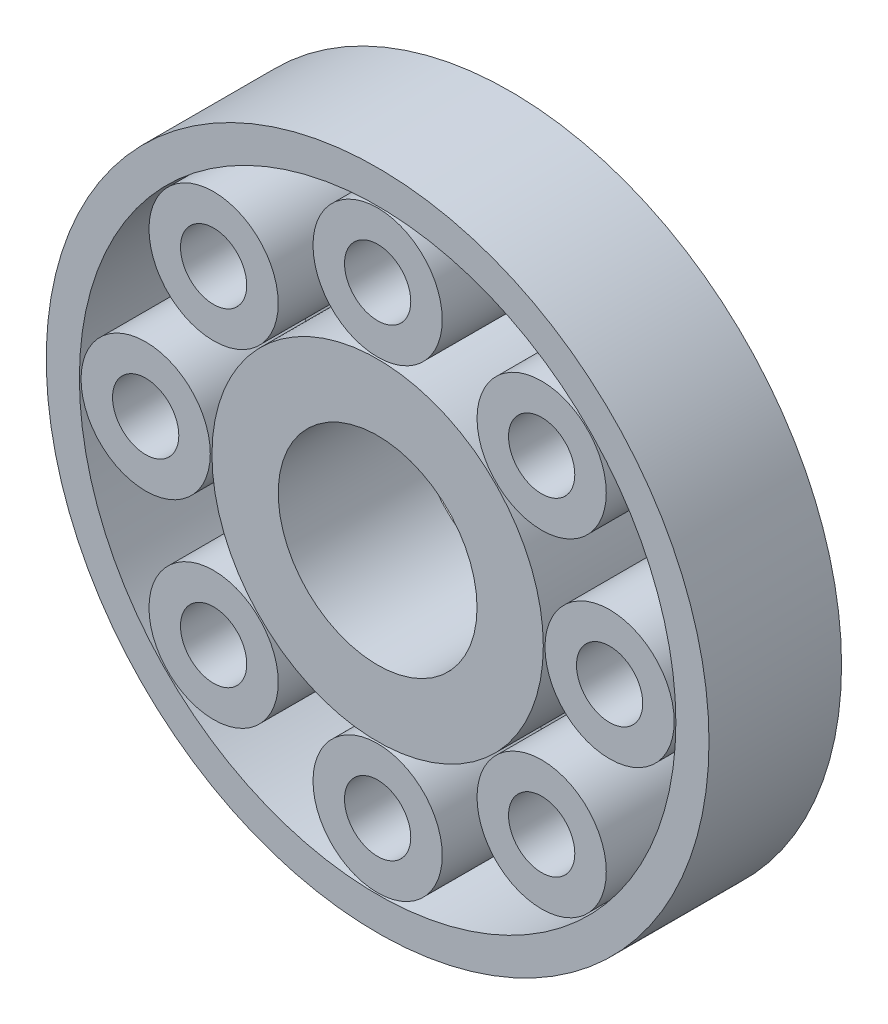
ISO-10303-21;
HEADER;
FILE_DESCRIPTION(('STEP AP214'),'2;1');
FILE_NAME('part.step','',(''),(''),'','','');
FILE_SCHEMA(('AUTOMOTIVE_DESIGN { 1 0 10303 214 1 1 1 1 }'));
ENDSEC;
DATA;
#1=APPLICATION_CONTEXT('core data for automotive mechanical design processes');
#2=APPLICATION_PROTOCOL_DEFINITION('international standard','automotive_design',2000,#1);
#3=PRODUCT_CONTEXT('',#1,'mechanical');
#4=PRODUCT('Part','Part','',(#3));
#5=PRODUCT_RELATED_PRODUCT_CATEGORY('part','',(#4));
#6=PRODUCT_DEFINITION_FORMATION('','',#4);
#7=PRODUCT_DEFINITION_CONTEXT('part definition',#1,'design');
#8=PRODUCT_DEFINITION('design','',#6,#7);
#9=PRODUCT_DEFINITION_SHAPE('','',#8);
#10=(LENGTH_UNIT() NAMED_UNIT(*) SI_UNIT(.MILLI.,.METRE.));
#11=(NAMED_UNIT(*) PLANE_ANGLE_UNIT() SI_UNIT($,.RADIAN.));
#12=(NAMED_UNIT(*) SI_UNIT($,.STERADIAN.) SOLID_ANGLE_UNIT());
#13=UNCERTAINTY_MEASURE_WITH_UNIT(LENGTH_MEASURE(1.E-05),#10,'distance_accuracy_value','');
#14=(GEOMETRIC_REPRESENTATION_CONTEXT(3) GLOBAL_UNCERTAINTY_ASSIGNED_CONTEXT((#13)) GLOBAL_UNIT_ASSIGNED_CONTEXT((#10,
#11,#12)) REPRESENTATION_CONTEXT('',''));
#15=CARTESIAN_POINT('',(0.,0.,0.));
#16=DIRECTION('',(0.,0.,1.));
#17=DIRECTION('',(1.,0.,0.));
#18=AXIS2_PLACEMENT_3D('',#15,#16,#17);
#19=CARTESIAN_POINT('',(0.,0.,0.));
#20=DIRECTION('',(0.,0.,1.));
#21=DIRECTION('',(1.,0.,0.));
#22=AXIS2_PLACEMENT_3D('',#19,#20,#21);
#23=PLANE('',#22);
#24=CARTESIAN_POINT('',(-4.94974746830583,4.94974746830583,0.));
#25=DIRECTION('',(0.,0.,1.));
#26=DIRECTION('',(1.,0.,0.));
#27=AXIS2_PLACEMENT_3D('',#24,#25,#26);
#28=CIRCLE('',#27,1.00000000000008);
#29=CARTESIAN_POINT('',(-3.94974746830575,4.94974746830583,0.));
#30=VERTEX_POINT('',#29);
#31=EDGE_CURVE('E164',#30,#30,#28,.F.);
#32=ORIENTED_EDGE('',*,*,#31,.F.);
#33=EDGE_LOOP('',(#32));
#34=FACE_BOUND('',#33,.T.);
#35=CARTESIAN_POINT('',(-7.,0.,0.));
#36=DIRECTION('',(0.,0.,1.));
#37=DIRECTION('',(1.,0.,0.));
#38=AXIS2_PLACEMENT_3D('',#35,#36,#37);
#39=CIRCLE('',#38,1.00000000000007);
#40=CARTESIAN_POINT('',(-5.99999999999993,0.,0.));
#41=VERTEX_POINT('',#40);
#42=EDGE_CURVE('E158',#41,#41,#39,.F.);
#43=ORIENTED_EDGE('',*,*,#42,.F.);
#44=EDGE_LOOP('',(#43));
#45=FACE_BOUND('',#44,.T.);
#46=CARTESIAN_POINT('',(-4.94974746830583,-4.94974746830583,0.));
#47=DIRECTION('',(0.,0.,1.));
#48=DIRECTION('',(1.,0.,0.));
#49=AXIS2_PLACEMENT_3D('',#46,#47,#48);
#50=CIRCLE('',#49,1.00000000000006);
#51=CARTESIAN_POINT('',(-3.94974746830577,-4.94974746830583,0.));
#52=VERTEX_POINT('',#51);
#53=EDGE_CURVE('E152',#52,#52,#50,.F.);
#54=ORIENTED_EDGE('',*,*,#53,.F.);
#55=EDGE_LOOP('',(#54));
#56=FACE_BOUND('',#55,.T.);
#57=CARTESIAN_POINT('',(0.,-7.,0.));
#58=DIRECTION('',(0.,0.,1.));
#59=DIRECTION('',(1.,0.,0.));
#60=AXIS2_PLACEMENT_3D('',#57,#58,#59);
#61=CIRCLE('',#60,1.00000000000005);
#62=CARTESIAN_POINT('',(1.00000000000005,-7.,0.));
#63=VERTEX_POINT('',#62);
#64=EDGE_CURVE('E146',#63,#63,#61,.F.);
#65=ORIENTED_EDGE('',*,*,#64,.F.);
#66=EDGE_LOOP('',(#65));
#67=FACE_BOUND('',#66,.T.);
#68=CARTESIAN_POINT('',(4.94974746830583,-4.94974746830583,0.));
#69=DIRECTION('',(0.,0.,1.));
#70=DIRECTION('',(1.,0.,0.));
#71=AXIS2_PLACEMENT_3D('',#68,#69,#70);
#72=CIRCLE('',#71,1.00000000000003);
#73=CARTESIAN_POINT('',(5.94974746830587,-4.94974746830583,0.));
#74=VERTEX_POINT('',#73);
#75=EDGE_CURVE('E140',#74,#74,#72,.F.);
#76=ORIENTED_EDGE('',*,*,#75,.F.);
#77=EDGE_LOOP('',(#76));
#78=FACE_BOUND('',#77,.T.);
#79=CARTESIAN_POINT('',(7.,0.,0.));
#80=DIRECTION('',(0.,0.,1.));
#81=DIRECTION('',(1.,0.,0.));
#82=AXIS2_PLACEMENT_3D('',#79,#80,#81);
#83=CIRCLE('',#82,1.00000000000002);
#84=CARTESIAN_POINT('',(8.00000000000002,0.,0.));
#85=VERTEX_POINT('',#84);
#86=EDGE_CURVE('E134',#85,#85,#83,.F.);
#87=ORIENTED_EDGE('',*,*,#86,.F.);
#88=EDGE_LOOP('',(#87));
#89=FACE_BOUND('',#88,.T.);
#90=CARTESIAN_POINT('',(4.94974746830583,4.94974746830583,0.));
#91=DIRECTION('',(0.,0.,1.));
#92=DIRECTION('',(1.,0.,0.));
#93=AXIS2_PLACEMENT_3D('',#90,#91,#92);
#94=CIRCLE('',#93,1.00000000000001);
#95=CARTESIAN_POINT('',(5.94974746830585,4.94974746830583,0.));
#96=VERTEX_POINT('',#95);
#97=EDGE_CURVE('E128',#96,#96,#94,.F.);
#98=ORIENTED_EDGE('',*,*,#97,.F.);
#99=EDGE_LOOP('',(#98));
#100=FACE_BOUND('',#99,.T.);
#101=CARTESIAN_POINT('',(0.,7.,0.));
#102=DIRECTION('',(0.,0.,1.));
#103=DIRECTION('',(1.,0.,0.));
#104=AXIS2_PLACEMENT_3D('',#101,#102,#103);
#105=CIRCLE('',#104,1.);
#106=CARTESIAN_POINT('',(1.,7.,0.));
#107=VERTEX_POINT('',#106);
#108=EDGE_CURVE('E120',#107,#107,#105,.F.);
#109=ORIENTED_EDGE('',*,*,#108,.F.);
#110=EDGE_LOOP('',(#109));
#111=FACE_BOUND('',#110,.T.);
#112=CARTESIAN_POINT('',(0.,0.,0.));
#113=DIRECTION('',(0.,0.,1.));
#114=DIRECTION('',(1.,0.,0.));
#115=AXIS2_PLACEMENT_3D('',#112,#113,#114);
#116=CIRCLE('',#115,10.);
#117=CARTESIAN_POINT('',(10.,0.,0.));
#118=VERTEX_POINT('',#117);
#119=EDGE_CURVE('E51',#118,#118,#116,.T.);
#120=ORIENTED_EDGE('',*,*,#119,.F.);
#121=EDGE_LOOP('',(#120));
#122=FACE_BOUND('',#121,.T.);
#123=CARTESIAN_POINT('',(0.,0.,0.));
#124=DIRECTION('',(0.,0.,1.));
#125=DIRECTION('',(1.,0.,0.));
#126=AXIS2_PLACEMENT_3D('',#123,#124,#125);
#127=CIRCLE('',#126,4.);
#128=CARTESIAN_POINT('',(4.,0.,0.));
#129=VERTEX_POINT('',#128);
#130=EDGE_CURVE('E44',#129,#129,#127,.F.);
#131=ORIENTED_EDGE('',*,*,#130,.F.);
#132=EDGE_LOOP('',(#131));
#133=FACE_BOUND('',#132,.T.);
#134=ADVANCED_FACE('F33',(#34,#45,#56,#67,#78,#89,#100,#111,#122,#133),#23,.F.);
#135=CARTESIAN_POINT('',(0.,0.,4.));
#136=DIRECTION('',(0.,0.,-1.));
#137=DIRECTION('',(-1.,0.,0.));
#138=AXIS2_PLACEMENT_3D('',#135,#136,#137);
#139=CYLINDRICAL_SURFACE('',#138,10.);
#140=CARTESIAN_POINT('',(0.,0.,4.));
#141=DIRECTION('',(0.,0.,1.));
#142=DIRECTION('',(1.,0.,0.));
#143=AXIS2_PLACEMENT_3D('',#140,#141,#142);
#144=CIRCLE('',#143,10.);
#145=CARTESIAN_POINT('',(10.,0.,4.));
#146=VERTEX_POINT('',#145);
#147=EDGE_CURVE('E48',#146,#146,#144,.T.);
#148=ORIENTED_EDGE('',*,*,#147,.F.);
#149=EDGE_LOOP('',(#148));
#150=FACE_BOUND('',#149,.T.);
#151=ORIENTED_EDGE('',*,*,#119,.T.);
#152=EDGE_LOOP('',(#151));
#153=FACE_BOUND('',#152,.T.);
#154=ADVANCED_FACE('F200',(#150,#153),#139,.T.);
#155=CARTESIAN_POINT('',(0.,0.,4.));
#156=DIRECTION('',(0.,0.,1.));
#157=DIRECTION('',(1.,0.,0.));
#158=AXIS2_PLACEMENT_3D('',#155,#156,#157);
#159=PLANE('',#158);
#160=CARTESIAN_POINT('',(0.,0.,4.));
#161=DIRECTION('',(0.,0.,1.));
#162=DIRECTION('',(1.,0.,0.));
#163=AXIS2_PLACEMENT_3D('',#160,#161,#162);
#164=CIRCLE('',#163,9.);
#165=CARTESIAN_POINT('',(9.,0.,4.));
#166=VERTEX_POINT('',#165);
#167=EDGE_CURVE('E57',#166,#166,#164,.F.);
#168=ORIENTED_EDGE('',*,*,#167,.T.);
#169=EDGE_LOOP('',(#168));
#170=FACE_BOUND('',#169,.T.);
#171=ORIENTED_EDGE('',*,*,#147,.T.);
#172=EDGE_LOOP('',(#171));
#173=FACE_BOUND('',#172,.T.);
#174=ADVANCED_FACE('F206',(#170,#173),#159,.T.);
#175=CARTESIAN_POINT('',(0.,7.,29.4558441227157));
#176=DIRECTION('',(0.,0.,-1.));
#177=DIRECTION('',(-1.,0.,0.));
#178=AXIS2_PLACEMENT_3D('',#175,#176,#177);
#179=CYLINDRICAL_SURFACE('',#178,1.95);
#180=CARTESIAN_POINT('',(0.,7.,0.5));
#181=DIRECTION('',(0.,0.,-1.));
#182=DIRECTION('',(-1.,0.,0.));
#183=AXIS2_PLACEMENT_3D('',#180,#181,#182);
#184=CIRCLE('',#183,1.95);
#185=CARTESIAN_POINT('',(-1.95,7.,0.5));
#186=VERTEX_POINT('',#185);
#187=EDGE_CURVE('E66',#186,#186,#184,.T.);
#188=ORIENTED_EDGE('',*,*,#187,.F.);
#189=EDGE_LOOP('',(#188));
#190=FACE_BOUND('',#189,.T.);
#191=CARTESIAN_POINT('',(0.,7.,4.));
#192=DIRECTION('',(0.,0.,1.));
#193=DIRECTION('',(1.,0.,0.));
#194=AXIS2_PLACEMENT_3D('',#191,#192,#193);
#195=CIRCLE('',#194,1.95);
#196=CARTESIAN_POINT('',(1.95,7.,4.));
#197=VERTEX_POINT('',#196);
#198=EDGE_CURVE('E54',#197,#197,#195,.F.);
#199=ORIENTED_EDGE('',*,*,#198,.T.);
#200=EDGE_LOOP('',(#199));
#201=FACE_BOUND('',#200,.T.);
#202=ADVANCED_FACE('F195',(#190,#201),#179,.T.);
#203=CARTESIAN_POINT('',(0.,0.,29.4558441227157));
#204=DIRECTION('',(0.,0.,-1.));
#205=DIRECTION('',(-1.,0.,0.));
#206=AXIS2_PLACEMENT_3D('',#203,#204,#205);
#207=CYLINDRICAL_SURFACE('',#206,5.);
#208=CARTESIAN_POINT('',(0.,0.,0.5));
#209=DIRECTION('',(0.,0.,-1.));
#210=DIRECTION('',(-1.,0.,0.));
#211=AXIS2_PLACEMENT_3D('',#208,#209,#210);
#212=CIRCLE('',#211,5.);
#213=CARTESIAN_POINT('',(-5.,0.,0.5));
#214=VERTEX_POINT('',#213);
#215=EDGE_CURVE('E69',#214,#214,#212,.T.);
#216=ORIENTED_EDGE('',*,*,#215,.F.);
#217=EDGE_LOOP('',(#216));
#218=FACE_BOUND('',#217,.T.);
#219=CARTESIAN_POINT('',(0.,0.,4.));
#220=DIRECTION('',(0.,0.,1.));
#221=DIRECTION('',(1.,0.,0.));
#222=AXIS2_PLACEMENT_3D('',#219,#220,#221);
#223=CIRCLE('',#222,5.);
#224=CARTESIAN_POINT('',(5.,0.,4.));
#225=VERTEX_POINT('',#224);
#226=EDGE_CURVE('E94',#225,#225,#223,.F.);
#227=ORIENTED_EDGE('',*,*,#226,.T.);
#228=EDGE_LOOP('',(#227));
#229=FACE_BOUND('',#228,.T.);
#230=ADVANCED_FACE('F185',(#218,#229),#207,.T.);
#231=CARTESIAN_POINT('',(-4.94974746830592,4.94974746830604,29.4558441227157));
#232=DIRECTION('',(0.,0.,-1.));
#233=DIRECTION('',(-1.,0.,0.));
#234=AXIS2_PLACEMENT_3D('',#231,#232,#233);
#235=CYLINDRICAL_SURFACE('',#234,1.95);
#236=CARTESIAN_POINT('',(-4.94974746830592,4.94974746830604,0.5));
#237=DIRECTION('',(0.,0.,-1.));
#238=DIRECTION('',(-1.,0.,0.));
#239=AXIS2_PLACEMENT_3D('',#236,#237,#238);
#240=CIRCLE('',#239,1.95);
#241=CARTESIAN_POINT('',(-6.89974746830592,4.94974746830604,0.5));
#242=VERTEX_POINT('',#241);
#243=EDGE_CURVE('E72',#242,#242,#240,.T.);
#244=ORIENTED_EDGE('',*,*,#243,.F.);
#245=EDGE_LOOP('',(#244));
#246=FACE_BOUND('',#245,.T.);
#247=CARTESIAN_POINT('',(-4.94974746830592,4.94974746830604,4.));
#248=DIRECTION('',(0.,0.,1.));
#249=DIRECTION('',(1.,0.,0.));
#250=AXIS2_PLACEMENT_3D('',#247,#248,#249);
#251=CIRCLE('',#250,1.95);
#252=CARTESIAN_POINT('',(-2.99974746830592,4.94974746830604,4.));
#253=VERTEX_POINT('',#252);
#254=EDGE_CURVE('E97',#253,#253,#251,.F.);
#255=ORIENTED_EDGE('',*,*,#254,.T.);
#256=EDGE_LOOP('',(#255));
#257=FACE_BOUND('',#256,.T.);
#258=ADVANCED_FACE('F182',(#246,#257),#235,.T.);
#259=CARTESIAN_POINT('',(-7.0000000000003,2.97570696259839E-13,29.4558441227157));
#260=DIRECTION('',(0.,0.,-1.));
#261=DIRECTION('',(-1.,0.,0.));
#262=AXIS2_PLACEMENT_3D('',#259,#260,#261);
#263=CYLINDRICAL_SURFACE('',#262,1.95);
#264=CARTESIAN_POINT('',(-7.0000000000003,2.97570696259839E-13,0.5));
#265=DIRECTION('',(0.,0.,-1.));
#266=DIRECTION('',(-1.,0.,0.));
#267=AXIS2_PLACEMENT_3D('',#264,#265,#266);
#268=CIRCLE('',#267,1.95);
#269=CARTESIAN_POINT('',(-8.9500000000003,2.97570696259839E-13,0.5));
#270=VERTEX_POINT('',#269);
#271=EDGE_CURVE('E75',#270,#270,#268,.T.);
#272=ORIENTED_EDGE('',*,*,#271,.F.);
#273=EDGE_LOOP('',(#272));
#274=FACE_BOUND('',#273,.T.);
#275=CARTESIAN_POINT('',(-7.0000000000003,2.97570696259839E-13,4.));
#276=DIRECTION('',(0.,0.,1.));
#277=DIRECTION('',(1.,0.,0.));
#278=AXIS2_PLACEMENT_3D('',#275,#276,#277);
#279=CIRCLE('',#278,1.95);
#280=CARTESIAN_POINT('',(-5.0500000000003,2.97570696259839E-13,4.));
#281=VERTEX_POINT('',#280);
#282=EDGE_CURVE('E100',#281,#281,#279,.F.);
#283=ORIENTED_EDGE('',*,*,#282,.T.);
#284=EDGE_LOOP('',(#283));
#285=FACE_BOUND('',#284,.T.);
#286=ADVANCED_FACE('F184',(#274,#285),#263,.T.);
#287=CARTESIAN_POINT('',(-4.94974746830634,-4.94974746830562,29.4558441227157));
#288=DIRECTION('',(0.,0.,-1.));
#289=DIRECTION('',(-1.,0.,0.));
#290=AXIS2_PLACEMENT_3D('',#287,#288,#289);
#291=CYLINDRICAL_SURFACE('',#290,1.95);
#292=CARTESIAN_POINT('',(-4.94974746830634,-4.94974746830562,0.5));
#293=DIRECTION('',(0.,0.,-1.));
#294=DIRECTION('',(-1.,0.,0.));
#295=AXIS2_PLACEMENT_3D('',#292,#293,#294);
#296=CIRCLE('',#295,1.95);
#297=CARTESIAN_POINT('',(-6.89974746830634,-4.94974746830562,0.5));
#298=VERTEX_POINT('',#297);
#299=EDGE_CURVE('E78',#298,#298,#296,.T.);
#300=ORIENTED_EDGE('',*,*,#299,.F.);
#301=EDGE_LOOP('',(#300));
#302=FACE_BOUND('',#301,.T.);
#303=CARTESIAN_POINT('',(-4.94974746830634,-4.94974746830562,4.));
#304=DIRECTION('',(0.,0.,1.));
#305=DIRECTION('',(1.,0.,0.));
#306=AXIS2_PLACEMENT_3D('',#303,#304,#305);
#307=CIRCLE('',#306,1.95);
#308=CARTESIAN_POINT('',(-2.99974746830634,-4.94974746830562,4.));
#309=VERTEX_POINT('',#308);
#310=EDGE_CURVE('E103',#309,#309,#307,.F.);
#311=ORIENTED_EDGE('',*,*,#310,.T.);
#312=EDGE_LOOP('',(#311));
#313=FACE_BOUND('',#312,.T.);
#314=ADVANCED_FACE('F192',(#302,#313),#291,.T.);
#315=CARTESIAN_POINT('',(-5.95141392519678E-13,-7.,29.4558441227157));
#316=DIRECTION('',(0.,0.,-1.));
#317=DIRECTION('',(-1.,0.,0.));
#318=AXIS2_PLACEMENT_3D('',#315,#316,#317);
#319=CYLINDRICAL_SURFACE('',#318,1.95);
#320=CARTESIAN_POINT('',(-5.95141392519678E-13,-7.,0.5));
#321=DIRECTION('',(0.,0.,-1.));
#322=DIRECTION('',(-1.,0.,0.));
#323=AXIS2_PLACEMENT_3D('',#320,#321,#322);
#324=CIRCLE('',#323,1.95);
#325=CARTESIAN_POINT('',(-1.9500000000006,-7.,0.5));
#326=VERTEX_POINT('',#325);
#327=EDGE_CURVE('E81',#326,#326,#324,.T.);
#328=ORIENTED_EDGE('',*,*,#327,.F.);
#329=EDGE_LOOP('',(#328));
#330=FACE_BOUND('',#329,.T.);
#331=CARTESIAN_POINT('',(-5.95141392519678E-13,-7.,4.));
#332=DIRECTION('',(0.,0.,1.));
#333=DIRECTION('',(1.,0.,0.));
#334=AXIS2_PLACEMENT_3D('',#331,#332,#333);
#335=CIRCLE('',#334,1.95);
#336=CARTESIAN_POINT('',(1.9499999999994,-7.,4.));
#337=VERTEX_POINT('',#336);
#338=EDGE_CURVE('E106',#337,#337,#335,.F.);
#339=ORIENTED_EDGE('',*,*,#338,.T.);
#340=EDGE_LOOP('',(#339));
#341=FACE_BOUND('',#340,.T.);
#342=ADVANCED_FACE('F227',(#330,#341),#319,.T.);
#343=CARTESIAN_POINT('',(4.94974746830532,-4.94974746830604,29.4558441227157));
#344=DIRECTION('',(0.,0.,-1.));
#345=DIRECTION('',(-1.,0.,0.));
#346=AXIS2_PLACEMENT_3D('',#343,#344,#345);
#347=CYLINDRICAL_SURFACE('',#346,1.95);
#348=CARTESIAN_POINT('',(4.94974746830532,-4.94974746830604,0.5));
#349=DIRECTION('',(0.,0.,-1.));
#350=DIRECTION('',(-1.,0.,0.));
#351=AXIS2_PLACEMENT_3D('',#348,#349,#350);
#352=CIRCLE('',#351,1.95);
#353=CARTESIAN_POINT('',(2.99974746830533,-4.94974746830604,0.5));
#354=VERTEX_POINT('',#353);
#355=EDGE_CURVE('E84',#354,#354,#352,.T.);
#356=ORIENTED_EDGE('',*,*,#355,.F.);
#357=EDGE_LOOP('',(#356));
#358=FACE_BOUND('',#357,.T.);
#359=CARTESIAN_POINT('',(4.94974746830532,-4.94974746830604,4.));
#360=DIRECTION('',(0.,0.,1.));
#361=DIRECTION('',(1.,0.,0.));
#362=AXIS2_PLACEMENT_3D('',#359,#360,#361);
#363=CIRCLE('',#362,1.95);
#364=CARTESIAN_POINT('',(6.89974746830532,-4.94974746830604,4.));
#365=VERTEX_POINT('',#364);
#366=EDGE_CURVE('E109',#365,#365,#363,.F.);
#367=ORIENTED_EDGE('',*,*,#366,.T.);
#368=EDGE_LOOP('',(#367));
#369=FACE_BOUND('',#368,.T.);
#370=ADVANCED_FACE('F223',(#358,#369),#347,.T.);
#371=CARTESIAN_POINT('',(6.9999999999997,-2.98427949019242E-13,29.4558441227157));
#372=DIRECTION('',(0.,0.,-1.));
#373=DIRECTION('',(-1.,0.,0.));
#374=AXIS2_PLACEMENT_3D('',#371,#372,#373);
#375=CYLINDRICAL_SURFACE('',#374,1.95);
#376=CARTESIAN_POINT('',(6.9999999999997,-2.98427949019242E-13,0.5));
#377=DIRECTION('',(0.,0.,-1.));
#378=DIRECTION('',(-1.,0.,0.));
#379=AXIS2_PLACEMENT_3D('',#376,#377,#378);
#380=CIRCLE('',#379,1.95);
#381=CARTESIAN_POINT('',(5.0499999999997,-2.98427949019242E-13,0.5));
#382=VERTEX_POINT('',#381);
#383=EDGE_CURVE('E87',#382,#382,#380,.T.);
#384=ORIENTED_EDGE('',*,*,#383,.F.);
#385=EDGE_LOOP('',(#384));
#386=FACE_BOUND('',#385,.T.);
#387=CARTESIAN_POINT('',(6.9999999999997,-2.98427949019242E-13,4.));
#388=DIRECTION('',(0.,0.,1.));
#389=DIRECTION('',(1.,0.,0.));
#390=AXIS2_PLACEMENT_3D('',#387,#388,#389);
#391=CIRCLE('',#390,1.95);
#392=CARTESIAN_POINT('',(8.9499999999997,-2.98427949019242E-13,4.));
#393=VERTEX_POINT('',#392);
#394=EDGE_CURVE('E112',#393,#393,#391,.F.);
#395=ORIENTED_EDGE('',*,*,#394,.T.);
#396=EDGE_LOOP('',(#395));
#397=FACE_BOUND('',#396,.T.);
#398=ADVANCED_FACE('F219',(#386,#397),#375,.T.);
#399=CARTESIAN_POINT('',(4.94974746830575,4.94974746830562,29.4558441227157));
#400=DIRECTION('',(0.,0.,-1.));
#401=DIRECTION('',(-1.,0.,0.));
#402=AXIS2_PLACEMENT_3D('',#399,#400,#401);
#403=CYLINDRICAL_SURFACE('',#402,1.95);
#404=CARTESIAN_POINT('',(4.94974746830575,4.94974746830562,0.5));
#405=DIRECTION('',(0.,0.,-1.));
#406=DIRECTION('',(-1.,0.,0.));
#407=AXIS2_PLACEMENT_3D('',#404,#405,#406);
#408=CIRCLE('',#407,1.95);
#409=CARTESIAN_POINT('',(2.99974746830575,4.94974746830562,0.5));
#410=VERTEX_POINT('',#409);
#411=EDGE_CURVE('E60',#410,#410,#408,.T.);
#412=ORIENTED_EDGE('',*,*,#411,.F.);
#413=EDGE_LOOP('',(#412));
#414=FACE_BOUND('',#413,.T.);
#415=CARTESIAN_POINT('',(4.94974746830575,4.94974746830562,4.));
#416=DIRECTION('',(0.,0.,1.));
#417=DIRECTION('',(1.,0.,0.));
#418=AXIS2_PLACEMENT_3D('',#415,#416,#417);
#419=CIRCLE('',#418,1.95);
#420=CARTESIAN_POINT('',(6.89974746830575,4.94974746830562,4.));
#421=VERTEX_POINT('',#420);
#422=EDGE_CURVE('E65',#421,#421,#419,.F.);
#423=ORIENTED_EDGE('',*,*,#422,.T.);
#424=EDGE_LOOP('',(#423));
#425=FACE_BOUND('',#424,.T.);
#426=ADVANCED_FACE('F215',(#414,#425),#403,.T.);
#427=CARTESIAN_POINT('',(0.,0.,0.5));
#428=DIRECTION('',(0.,0.,-1.));
#429=DIRECTION('',(-1.,0.,0.));
#430=AXIS2_PLACEMENT_3D('',#427,#428,#429);
#431=PLANE('',#430);
#432=ORIENTED_EDGE('',*,*,#411,.T.);
#433=EDGE_LOOP('',(#432));
#434=FACE_BOUND('',#433,.T.);
#435=ORIENTED_EDGE('',*,*,#383,.T.);
#436=EDGE_LOOP('',(#435));
#437=FACE_BOUND('',#436,.T.);
#438=ORIENTED_EDGE('',*,*,#355,.T.);
#439=EDGE_LOOP('',(#438));
#440=FACE_BOUND('',#439,.T.);
#441=ORIENTED_EDGE('',*,*,#327,.T.);
#442=EDGE_LOOP('',(#441));
#443=FACE_BOUND('',#442,.T.);
#444=ORIENTED_EDGE('',*,*,#299,.T.);
#445=EDGE_LOOP('',(#444));
#446=FACE_BOUND('',#445,.T.);
#447=ORIENTED_EDGE('',*,*,#271,.T.);
#448=EDGE_LOOP('',(#447));
#449=FACE_BOUND('',#448,.T.);
#450=ORIENTED_EDGE('',*,*,#243,.T.);
#451=EDGE_LOOP('',(#450));
#452=FACE_BOUND('',#451,.T.);
#453=ORIENTED_EDGE('',*,*,#215,.T.);
#454=EDGE_LOOP('',(#453));
#455=FACE_BOUND('',#454,.T.);
#456=ORIENTED_EDGE('',*,*,#187,.T.);
#457=EDGE_LOOP('',(#456));
#458=FACE_BOUND('',#457,.T.);
#459=CARTESIAN_POINT('',(0.,0.,0.5));
#460=DIRECTION('',(0.,0.,-1.));
#461=DIRECTION('',(-1.,0.,0.));
#462=AXIS2_PLACEMENT_3D('',#459,#460,#461);
#463=CIRCLE('',#462,9.);
#464=CARTESIAN_POINT('',(-9.,0.,0.5));
#465=VERTEX_POINT('',#464);
#466=EDGE_CURVE('E62',#465,#465,#463,.T.);
#467=ORIENTED_EDGE('',*,*,#466,.F.);
#468=EDGE_LOOP('',(#467));
#469=FACE_BOUND('',#468,.T.);
#470=ADVANCED_FACE('F218',(#434,#437,#440,#443,#446,#449,#452,#455,#458,#469),#431,.F.);
#471=CARTESIAN_POINT('',(0.,0.,29.4558441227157));
#472=DIRECTION('',(0.,0.,-1.));
#473=DIRECTION('',(-1.,0.,0.));
#474=AXIS2_PLACEMENT_3D('',#471,#472,#473);
#475=CYLINDRICAL_SURFACE('',#474,9.);
#476=ORIENTED_EDGE('',*,*,#466,.T.);
#477=EDGE_LOOP('',(#476));
#478=FACE_BOUND('',#477,.T.);
#479=ORIENTED_EDGE('',*,*,#167,.F.);
#480=EDGE_LOOP('',(#479));
#481=FACE_BOUND('',#480,.T.);
#482=ADVANCED_FACE('F291',(#478,#481),#475,.F.);
#483=CARTESIAN_POINT('',(4.94974746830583,4.94974746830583,4.));
#484=DIRECTION('',(0.,0.,1.));
#485=DIRECTION('',(1.,0.,0.));
#486=AXIS2_PLACEMENT_3D('',#483,#484,#485);
#487=CIRCLE('',#486,1.00000000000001);
#488=CARTESIAN_POINT('',(5.94974746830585,4.94974746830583,4.));
#489=VERTEX_POINT('',#488);
#490=EDGE_CURVE('E131',#489,#489,#487,.T.);
#491=ORIENTED_EDGE('',*,*,#490,.F.);
#492=EDGE_LOOP('',(#491));
#493=FACE_BOUND('',#492,.T.);
#494=ORIENTED_EDGE('',*,*,#422,.F.);
#495=EDGE_LOOP('',(#494));
#496=FACE_BOUND('',#495,.T.);
#497=ADVANCED_FACE('F214',(#493,#496),#159,.T.);
#498=CARTESIAN_POINT('',(7.,0.,4.));
#499=DIRECTION('',(0.,0.,1.));
#500=DIRECTION('',(1.,0.,0.));
#501=AXIS2_PLACEMENT_3D('',#498,#499,#500);
#502=CIRCLE('',#501,1.00000000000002);
#503=CARTESIAN_POINT('',(8.00000000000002,0.,4.));
#504=VERTEX_POINT('',#503);
#505=EDGE_CURVE('E137',#504,#504,#502,.T.);
#506=ORIENTED_EDGE('',*,*,#505,.F.);
#507=EDGE_LOOP('',(#506));
#508=FACE_BOUND('',#507,.T.);
#509=ORIENTED_EDGE('',*,*,#394,.F.);
#510=EDGE_LOOP('',(#509));
#511=FACE_BOUND('',#510,.T.);
#512=ADVANCED_FACE('F384',(#508,#511),#159,.T.);
#513=CARTESIAN_POINT('',(4.94974746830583,-4.94974746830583,4.));
#514=DIRECTION('',(0.,0.,1.));
#515=DIRECTION('',(1.,0.,0.));
#516=AXIS2_PLACEMENT_3D('',#513,#514,#515);
#517=CIRCLE('',#516,1.00000000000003);
#518=CARTESIAN_POINT('',(5.94974746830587,-4.94974746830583,4.));
#519=VERTEX_POINT('',#518);
#520=EDGE_CURVE('E143',#519,#519,#517,.T.);
#521=ORIENTED_EDGE('',*,*,#520,.F.);
#522=EDGE_LOOP('',(#521));
#523=FACE_BOUND('',#522,.T.);
#524=ORIENTED_EDGE('',*,*,#366,.F.);
#525=EDGE_LOOP('',(#524));
#526=FACE_BOUND('',#525,.T.);
#527=ADVANCED_FACE('F249',(#523,#526),#159,.T.);
#528=CARTESIAN_POINT('',(0.,-7.,4.));
#529=DIRECTION('',(0.,0.,1.));
#530=DIRECTION('',(1.,0.,0.));
#531=AXIS2_PLACEMENT_3D('',#528,#529,#530);
#532=CIRCLE('',#531,1.00000000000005);
#533=CARTESIAN_POINT('',(1.00000000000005,-7.,4.));
#534=VERTEX_POINT('',#533);
#535=EDGE_CURVE('E149',#534,#534,#532,.T.);
#536=ORIENTED_EDGE('',*,*,#535,.F.);
#537=EDGE_LOOP('',(#536));
#538=FACE_BOUND('',#537,.T.);
#539=ORIENTED_EDGE('',*,*,#338,.F.);
#540=EDGE_LOOP('',(#539));
#541=FACE_BOUND('',#540,.T.);
#542=ADVANCED_FACE('F242',(#538,#541),#159,.T.);
#543=CARTESIAN_POINT('',(-4.94974746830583,-4.94974746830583,4.));
#544=DIRECTION('',(0.,0.,1.));
#545=DIRECTION('',(1.,0.,0.));
#546=AXIS2_PLACEMENT_3D('',#543,#544,#545);
#547=CIRCLE('',#546,1.00000000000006);
#548=CARTESIAN_POINT('',(-3.94974746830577,-4.94974746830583,4.));
#549=VERTEX_POINT('',#548);
#550=EDGE_CURVE('E155',#549,#549,#547,.T.);
#551=ORIENTED_EDGE('',*,*,#550,.F.);
#552=EDGE_LOOP('',(#551));
#553=FACE_BOUND('',#552,.T.);
#554=ORIENTED_EDGE('',*,*,#310,.F.);
#555=EDGE_LOOP('',(#554));
#556=FACE_BOUND('',#555,.T.);
#557=ADVANCED_FACE('F240',(#553,#556),#159,.T.);
#558=CARTESIAN_POINT('',(-7.,0.,4.));
#559=DIRECTION('',(0.,0.,1.));
#560=DIRECTION('',(1.,0.,0.));
#561=AXIS2_PLACEMENT_3D('',#558,#559,#560);
#562=CIRCLE('',#561,1.00000000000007);
#563=CARTESIAN_POINT('',(-5.99999999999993,0.,4.));
#564=VERTEX_POINT('',#563);
#565=EDGE_CURVE('E161',#564,#564,#562,.T.);
#566=ORIENTED_EDGE('',*,*,#565,.F.);
#567=EDGE_LOOP('',(#566));
#568=FACE_BOUND('',#567,.T.);
#569=ORIENTED_EDGE('',*,*,#282,.F.);
#570=EDGE_LOOP('',(#569));
#571=FACE_BOUND('',#570,.T.);
#572=ADVANCED_FACE('F178',(#568,#571),#159,.T.);
#573=CARTESIAN_POINT('',(-4.94974746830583,4.94974746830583,4.));
#574=DIRECTION('',(0.,0.,1.));
#575=DIRECTION('',(1.,0.,0.));
#576=AXIS2_PLACEMENT_3D('',#573,#574,#575);
#577=CIRCLE('',#576,1.00000000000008);
#578=CARTESIAN_POINT('',(-3.94974746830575,4.94974746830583,4.));
#579=VERTEX_POINT('',#578);
#580=EDGE_CURVE('E167',#579,#579,#577,.T.);
#581=ORIENTED_EDGE('',*,*,#580,.F.);
#582=EDGE_LOOP('',(#581));
#583=FACE_BOUND('',#582,.T.);
#584=ORIENTED_EDGE('',*,*,#254,.F.);
#585=EDGE_LOOP('',(#584));
#586=FACE_BOUND('',#585,.T.);
#587=ADVANCED_FACE('F174',(#583,#586),#159,.T.);
#588=CARTESIAN_POINT('',(0.,0.,4.));
#589=DIRECTION('',(0.,0.,1.));
#590=DIRECTION('',(1.,0.,0.));
#591=AXIS2_PLACEMENT_3D('',#588,#589,#590);
#592=CIRCLE('',#591,3.);
#593=CARTESIAN_POINT('',(3.,0.,4.));
#594=VERTEX_POINT('',#593);
#595=EDGE_CURVE('E61',#594,#594,#592,.T.);
#596=ORIENTED_EDGE('',*,*,#595,.F.);
#597=EDGE_LOOP('',(#596));
#598=FACE_BOUND('',#597,.T.);
#599=ORIENTED_EDGE('',*,*,#226,.F.);
#600=EDGE_LOOP('',(#599));
#601=FACE_BOUND('',#600,.T.);
#602=ADVANCED_FACE('F177',(#598,#601),#159,.T.);
#603=CARTESIAN_POINT('',(0.,7.,4.));
#604=DIRECTION('',(0.,0.,1.));
#605=DIRECTION('',(1.,0.,0.));
#606=AXIS2_PLACEMENT_3D('',#603,#604,#605);
#607=CIRCLE('',#606,1.);
#608=CARTESIAN_POINT('',(1.,7.,4.));
#609=VERTEX_POINT('',#608);
#610=EDGE_CURVE('E125',#609,#609,#607,.T.);
#611=ORIENTED_EDGE('',*,*,#610,.F.);
#612=EDGE_LOOP('',(#611));
#613=FACE_BOUND('',#612,.T.);
#614=ORIENTED_EDGE('',*,*,#198,.F.);
#615=EDGE_LOOP('',(#614));
#616=FACE_BOUND('',#615,.T.);
#617=ADVANCED_FACE('F213',(#613,#616),#159,.T.);
#618=CARTESIAN_POINT('',(0.,0.,-0.2));
#619=DIRECTION('',(0.,0.,1.));
#620=DIRECTION('',(1.,0.,0.));
#621=AXIS2_PLACEMENT_3D('',#618,#619,#620);
#622=CYLINDRICAL_SURFACE('',#621,4.);
#623=CARTESIAN_POINT('',(0.,0.,-0.1));
#624=DIRECTION('',(0.,0.,-1.));
#625=DIRECTION('',(-1.,0.,0.));
#626=AXIS2_PLACEMENT_3D('',#623,#624,#625);
#627=CIRCLE('',#626,4.);
#628=CARTESIAN_POINT('',(-4.,0.,-0.1));
#629=VERTEX_POINT('',#628);
#630=EDGE_CURVE('E10',#629,#629,#627,.F.);
#631=ORIENTED_EDGE('',*,*,#630,.T.);
#632=EDGE_LOOP('',(#631));
#633=FACE_BOUND('',#632,.T.);
#634=ORIENTED_EDGE('',*,*,#130,.T.);
#635=EDGE_LOOP('',(#634));
#636=FACE_BOUND('',#635,.T.);
#637=ADVANCED_FACE('F276',(#633,#636),#622,.T.);
#638=CARTESIAN_POINT('',(0.,0.,-0.2));
#639=DIRECTION('',(0.,0.,-1.));
#640=DIRECTION('',(-1.,0.,0.));
#641=AXIS2_PLACEMENT_3D('',#638,#639,#640);
#642=PLANE('',#641);
#643=CARTESIAN_POINT('',(0.,0.,-0.2));
#644=DIRECTION('',(0.,0.,-1.));
#645=DIRECTION('',(-1.,0.,0.));
#646=AXIS2_PLACEMENT_3D('',#643,#644,#645);
#647=CIRCLE('',#646,3.9);
#648=CARTESIAN_POINT('',(-3.9,0.,-0.2));
#649=VERTEX_POINT('',#648);
#650=EDGE_CURVE('E40',#649,#649,#647,.T.);
#651=ORIENTED_EDGE('',*,*,#650,.T.);
#652=EDGE_LOOP('',(#651));
#653=FACE_BOUND('',#652,.T.);
#654=CARTESIAN_POINT('',(0.,0.,-0.2));
#655=DIRECTION('',(0.,0.,-1.));
#656=DIRECTION('',(-1.,0.,0.));
#657=AXIS2_PLACEMENT_3D('',#654,#655,#656);
#658=CIRCLE('',#657,3.);
#659=CARTESIAN_POINT('',(-3.,0.,-0.2));
#660=VERTEX_POINT('',#659);
#661=EDGE_CURVE('E117',#660,#660,#658,.F.);
#662=ORIENTED_EDGE('',*,*,#661,.T.);
#663=EDGE_LOOP('',(#662));
#664=FACE_BOUND('',#663,.T.);
#665=ADVANCED_FACE('F278',(#653,#664),#642,.T.);
#666=CARTESIAN_POINT('',(0.,0.,-0.201));
#667=DIRECTION('',(0.,0.,1.));
#668=DIRECTION('',(1.,0.,0.));
#669=AXIS2_PLACEMENT_3D('',#666,#667,#668);
#670=CYLINDRICAL_SURFACE('',#669,3.);
#671=ORIENTED_EDGE('',*,*,#661,.F.);
#672=EDGE_LOOP('',(#671));
#673=FACE_BOUND('',#672,.T.);
#674=ORIENTED_EDGE('',*,*,#595,.T.);
#675=EDGE_LOOP('',(#674));
#676=FACE_BOUND('',#675,.T.);
#677=ADVANCED_FACE('F284',(#673,#676),#670,.F.);
#678=CARTESIAN_POINT('',(0.,7.,-0.201));
#679=DIRECTION('',(0.,0.,1.));
#680=DIRECTION('',(1.,0.,0.));
#681=AXIS2_PLACEMENT_3D('',#678,#679,#680);
#682=CYLINDRICAL_SURFACE('',#681,1.);
#683=ORIENTED_EDGE('',*,*,#610,.T.);
#684=EDGE_LOOP('',(#683));
#685=FACE_BOUND('',#684,.T.);
#686=ORIENTED_EDGE('',*,*,#108,.T.);
#687=EDGE_LOOP('',(#686));
#688=FACE_BOUND('',#687,.T.);
#689=ADVANCED_FACE('F446',(#685,#688),#682,.F.);
#690=CARTESIAN_POINT('',(4.94974746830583,4.94974746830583,-0.201));
#691=DIRECTION('',(0.,0.,1.));
#692=DIRECTION('',(1.,0.,0.));
#693=AXIS2_PLACEMENT_3D('',#690,#691,#692);
#694=CYLINDRICAL_SURFACE('',#693,1.00000000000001);
#695=ORIENTED_EDGE('',*,*,#490,.T.);
#696=EDGE_LOOP('',(#695));
#697=FACE_BOUND('',#696,.T.);
#698=ORIENTED_EDGE('',*,*,#97,.T.);
#699=EDGE_LOOP('',(#698));
#700=FACE_BOUND('',#699,.T.);
#701=ADVANCED_FACE('F456',(#697,#700),#694,.F.);
#702=CARTESIAN_POINT('',(7.,0.,-0.201));
#703=DIRECTION('',(0.,0.,1.));
#704=DIRECTION('',(1.,0.,0.));
#705=AXIS2_PLACEMENT_3D('',#702,#703,#704);
#706=CYLINDRICAL_SURFACE('',#705,1.00000000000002);
#707=ORIENTED_EDGE('',*,*,#505,.T.);
#708=EDGE_LOOP('',(#707));
#709=FACE_BOUND('',#708,.T.);
#710=ORIENTED_EDGE('',*,*,#86,.T.);
#711=EDGE_LOOP('',(#710));
#712=FACE_BOUND('',#711,.T.);
#713=ADVANCED_FACE('F466',(#709,#712),#706,.F.);
#714=CARTESIAN_POINT('',(4.94974746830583,-4.94974746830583,-0.201));
#715=DIRECTION('',(0.,0.,1.));
#716=DIRECTION('',(1.,0.,0.));
#717=AXIS2_PLACEMENT_3D('',#714,#715,#716);
#718=CYLINDRICAL_SURFACE('',#717,1.00000000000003);
#719=ORIENTED_EDGE('',*,*,#520,.T.);
#720=EDGE_LOOP('',(#719));
#721=FACE_BOUND('',#720,.T.);
#722=ORIENTED_EDGE('',*,*,#75,.T.);
#723=EDGE_LOOP('',(#722));
#724=FACE_BOUND('',#723,.T.);
#725=ADVANCED_FACE('F476',(#721,#724),#718,.F.);
#726=CARTESIAN_POINT('',(0.,-7.,-0.201));
#727=DIRECTION('',(0.,0.,1.));
#728=DIRECTION('',(1.,0.,0.));
#729=AXIS2_PLACEMENT_3D('',#726,#727,#728);
#730=CYLINDRICAL_SURFACE('',#729,1.00000000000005);
#731=ORIENTED_EDGE('',*,*,#535,.T.);
#732=EDGE_LOOP('',(#731));
#733=FACE_BOUND('',#732,.T.);
#734=ORIENTED_EDGE('',*,*,#64,.T.);
#735=EDGE_LOOP('',(#734));
#736=FACE_BOUND('',#735,.T.);
#737=ADVANCED_FACE('F257',(#733,#736),#730,.F.);
#738=CARTESIAN_POINT('',(-4.94974746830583,-4.94974746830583,-0.201));
#739=DIRECTION('',(0.,0.,1.));
#740=DIRECTION('',(1.,0.,0.));
#741=AXIS2_PLACEMENT_3D('',#738,#739,#740);
#742=CYLINDRICAL_SURFACE('',#741,1.00000000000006);
#743=ORIENTED_EDGE('',*,*,#550,.T.);
#744=EDGE_LOOP('',(#743));
#745=FACE_BOUND('',#744,.T.);
#746=ORIENTED_EDGE('',*,*,#53,.T.);
#747=EDGE_LOOP('',(#746));
#748=FACE_BOUND('',#747,.T.);
#749=ADVANCED_FACE('F253',(#745,#748),#742,.F.);
#750=CARTESIAN_POINT('',(-7.,0.,-0.201));
#751=DIRECTION('',(0.,0.,1.));
#752=DIRECTION('',(1.,0.,0.));
#753=AXIS2_PLACEMENT_3D('',#750,#751,#752);
#754=CYLINDRICAL_SURFACE('',#753,1.00000000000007);
#755=ORIENTED_EDGE('',*,*,#565,.T.);
#756=EDGE_LOOP('',(#755));
#757=FACE_BOUND('',#756,.T.);
#758=ORIENTED_EDGE('',*,*,#42,.T.);
#759=EDGE_LOOP('',(#758));
#760=FACE_BOUND('',#759,.T.);
#761=ADVANCED_FACE('F256',(#757,#760),#754,.F.);
#762=CARTESIAN_POINT('',(-4.94974746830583,4.94974746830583,-0.201));
#763=DIRECTION('',(0.,0.,1.));
#764=DIRECTION('',(1.,0.,0.));
#765=AXIS2_PLACEMENT_3D('',#762,#763,#764);
#766=CYLINDRICAL_SURFACE('',#765,1.00000000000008);
#767=ORIENTED_EDGE('',*,*,#580,.T.);
#768=EDGE_LOOP('',(#767));
#769=FACE_BOUND('',#768,.T.);
#770=ORIENTED_EDGE('',*,*,#31,.T.);
#771=EDGE_LOOP('',(#770));
#772=FACE_BOUND('',#771,.T.);
#773=ADVANCED_FACE('F171',(#769,#772),#766,.F.);
#774=CARTESIAN_POINT('',(0.,0.,-0.1));
#775=DIRECTION('',(0.,0.,-1.));
#776=DIRECTION('',(-1.,0.,0.));
#777=AXIS2_PLACEMENT_3D('',#774,#775,#776);
#778=TOROIDAL_SURFACE('',#777,3.9,0.1);
#779=ORIENTED_EDGE('',*,*,#630,.F.);
#780=EDGE_LOOP('',(#779));
#781=FACE_BOUND('',#780,.T.);
#782=ORIENTED_EDGE('',*,*,#650,.F.);
#783=EDGE_LOOP('',(#782));
#784=FACE_BOUND('',#783,.T.);
#785=ADVANCED_FACE('F35',(#781,#784),#778,.T.);
#786=CLOSED_SHELL('',(#134,#154,#174,#202,#230,#258,#286,#314,#342,#370,#398,#426,#470,#482,
#497,#512,#527,#542,#557,#572,#587,#602,#617,#637,#665,#677,#689,#701,#713,#725,#737,#749,#761,
#773,#785));
#787=MANIFOLD_SOLID_BREP('B2',#786);
#788=ADVANCED_BREP_SHAPE_REPRESENTATION('',(#18,#787),#14);
#789=SHAPE_DEFINITION_REPRESENTATION(#9,#788);
ENDSEC;
END-ISO-10303-21;
